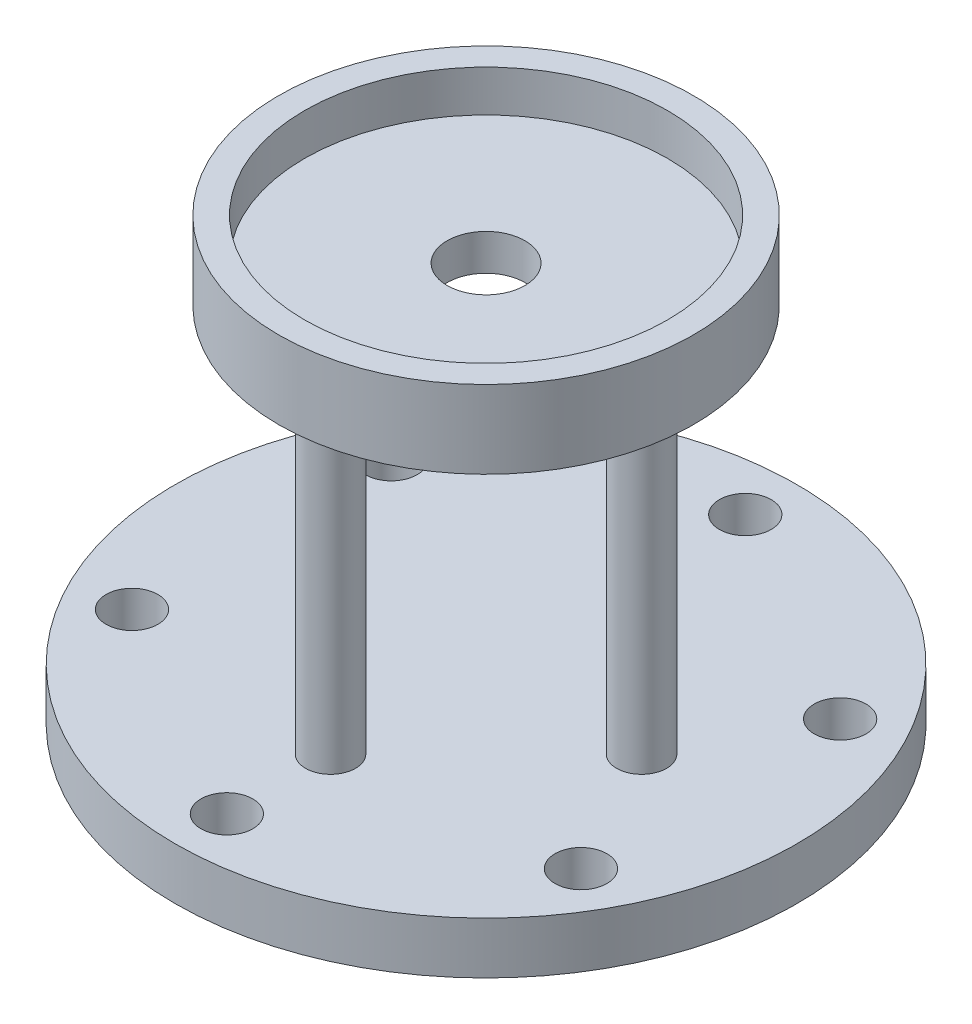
ISO-10303-21;
HEADER;
FILE_DESCRIPTION(('STEP AP214'),'2;1');
FILE_NAME('part.step','',(''),(''),'','','');
FILE_SCHEMA(('AUTOMOTIVE_DESIGN { 1 0 10303 214 1 1 1 1 }'));
ENDSEC;
DATA;
#1=APPLICATION_CONTEXT('core data for automotive mechanical design processes');
#2=APPLICATION_PROTOCOL_DEFINITION('international standard','automotive_design',2000,#1);
#3=PRODUCT_CONTEXT('',#1,'mechanical');
#4=PRODUCT('Part','Part','',(#3));
#5=PRODUCT_RELATED_PRODUCT_CATEGORY('part','',(#4));
#6=PRODUCT_DEFINITION_FORMATION('','',#4);
#7=PRODUCT_DEFINITION_CONTEXT('part definition',#1,'design');
#8=PRODUCT_DEFINITION('design','',#6,#7);
#9=PRODUCT_DEFINITION_SHAPE('','',#8);
#10=(LENGTH_UNIT() NAMED_UNIT(*) SI_UNIT(.MILLI.,.METRE.));
#11=(NAMED_UNIT(*) PLANE_ANGLE_UNIT() SI_UNIT($,.RADIAN.));
#12=(NAMED_UNIT(*) SI_UNIT($,.STERADIAN.) SOLID_ANGLE_UNIT());
#13=UNCERTAINTY_MEASURE_WITH_UNIT(LENGTH_MEASURE(1.E-05),#10,'distance_accuracy_value','');
#14=(GEOMETRIC_REPRESENTATION_CONTEXT(3) GLOBAL_UNCERTAINTY_ASSIGNED_CONTEXT((#13)) GLOBAL_UNIT_ASSIGNED_CONTEXT((#10,
#11,#12)) REPRESENTATION_CONTEXT('',''));
#15=CARTESIAN_POINT('',(0.,0.,0.));
#16=DIRECTION('',(0.,0.,1.));
#17=DIRECTION('',(1.,0.,0.));
#18=AXIS2_PLACEMENT_3D('',#15,#16,#17);
#19=CARTESIAN_POINT('',(0.,77.,0.));
#20=DIRECTION('',(0.,1.,0.));
#21=DIRECTION('',(0.,0.,1.));
#22=AXIS2_PLACEMENT_3D('',#19,#20,#21);
#23=PLANE('',#22);
#24=CARTESIAN_POINT('',(0.,77.,0.));
#25=DIRECTION('',(0.,1.,0.));
#26=DIRECTION('',(0.,0.,1.));
#27=AXIS2_PLACEMENT_3D('',#24,#25,#26);
#28=CIRCLE('',#27,7.5);
#29=CARTESIAN_POINT('',(0.,77.,7.5));
#30=VERTEX_POINT('',#29);
#31=EDGE_CURVE('E119',#30,#30,#28,.T.);
#32=ORIENTED_EDGE('',*,*,#31,.F.);
#33=EDGE_LOOP('',(#32));
#34=FACE_BOUND('',#33,.T.);
#35=CARTESIAN_POINT('',(0.,77.,0.));
#36=DIRECTION('',(0.,1.,0.));
#37=DIRECTION('',(0.,0.,1.));
#38=AXIS2_PLACEMENT_3D('',#35,#36,#37);
#39=CIRCLE('',#38,35.);
#40=CARTESIAN_POINT('',(0.,77.,35.));
#41=VERTEX_POINT('',#40);
#42=EDGE_CURVE('E10',#41,#41,#39,.F.);
#43=ORIENTED_EDGE('',*,*,#42,.F.);
#44=EDGE_LOOP('',(#43));
#45=FACE_BOUND('',#44,.T.);
#46=ADVANCED_FACE('F39',(#34,#45),#23,.T.);
#47=CARTESIAN_POINT('',(0.,10.,0.));
#48=DIRECTION('',(0.,1.,0.));
#49=DIRECTION('',(0.,0.,1.));
#50=AXIS2_PLACEMENT_3D('',#47,#48,#49);
#51=PLANE('',#50);
#52=CARTESIAN_POINT('',(0.,10.,30.));
#53=DIRECTION('',(0.,1.,0.));
#54=DIRECTION('',(0.,0.,1.));
#55=AXIS2_PLACEMENT_3D('',#52,#53,#54);
#56=CIRCLE('',#55,4.81807950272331);
#57=CARTESIAN_POINT('',(0.,10.,34.8180795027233));
#58=VERTEX_POINT('',#57);
#59=EDGE_CURVE('E112',#58,#58,#56,.T.);
#60=ORIENTED_EDGE('',*,*,#59,.F.);
#61=EDGE_LOOP('',(#60));
#62=FACE_BOUND('',#61,.T.);
#63=CARTESIAN_POINT('',(30.,10.,0.));
#64=DIRECTION('',(0.,1.,0.));
#65=DIRECTION('',(0.,0.,1.));
#66=AXIS2_PLACEMENT_3D('',#63,#64,#65);
#67=CIRCLE('',#66,4.81807950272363);
#68=CARTESIAN_POINT('',(30.,10.,4.81807950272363));
#69=VERTEX_POINT('',#68);
#70=EDGE_CURVE('E109',#69,#69,#67,.T.);
#71=ORIENTED_EDGE('',*,*,#70,.F.);
#72=EDGE_LOOP('',(#71));
#73=FACE_BOUND('',#72,.T.);
#74=CARTESIAN_POINT('',(0.,10.,-30.));
#75=DIRECTION('',(0.,1.,0.));
#76=DIRECTION('',(0.,0.,1.));
#77=AXIS2_PLACEMENT_3D('',#74,#75,#76);
#78=CIRCLE('',#77,4.81807950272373);
#79=CARTESIAN_POINT('',(0.,10.,-25.1819204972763));
#80=VERTEX_POINT('',#79);
#81=EDGE_CURVE('E103',#80,#80,#78,.T.);
#82=ORIENTED_EDGE('',*,*,#81,.F.);
#83=EDGE_LOOP('',(#82));
#84=FACE_BOUND('',#83,.T.);
#85=CARTESIAN_POINT('',(-30.,10.,0.));
#86=DIRECTION('',(0.,1.,0.));
#87=DIRECTION('',(0.,0.,1.));
#88=AXIS2_PLACEMENT_3D('',#85,#86,#87);
#89=CIRCLE('',#88,4.81807950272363);
#90=CARTESIAN_POINT('',(-30.,10.,4.81807950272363));
#91=VERTEX_POINT('',#90);
#92=EDGE_CURVE('E96',#91,#91,#89,.T.);
#93=ORIENTED_EDGE('',*,*,#92,.F.);
#94=EDGE_LOOP('',(#93));
#95=FACE_BOUND('',#94,.T.);
#96=CARTESIAN_POINT('',(-43.3012701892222,10.,25.0000000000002));
#97=DIRECTION('',(0.,1.,0.));
#98=DIRECTION('',(0.,0.,1.));
#99=AXIS2_PLACEMENT_3D('',#96,#97,#98);
#100=CIRCLE('',#99,4.99999999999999);
#101=CARTESIAN_POINT('',(-43.3012701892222,10.,30.0000000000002));
#102=VERTEX_POINT('',#101);
#103=EDGE_CURVE('E78',#102,#102,#100,.T.);
#104=ORIENTED_EDGE('',*,*,#103,.F.);
#105=EDGE_LOOP('',(#104));
#106=FACE_BOUND('',#105,.T.);
#107=CARTESIAN_POINT('',(43.301270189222,10.,25.0000000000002));
#108=DIRECTION('',(0.,1.,0.));
#109=DIRECTION('',(0.,0.,1.));
#110=AXIS2_PLACEMENT_3D('',#107,#108,#109);
#111=CIRCLE('',#110,4.99999999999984);
#112=CARTESIAN_POINT('',(43.301270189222,10.,30.));
#113=VERTEX_POINT('',#112);
#114=EDGE_CURVE('E66',#113,#113,#111,.T.);
#115=ORIENTED_EDGE('',*,*,#114,.F.);
#116=EDGE_LOOP('',(#115));
#117=FACE_BOUND('',#116,.T.);
#118=CARTESIAN_POINT('',(0.,10.,-50.));
#119=DIRECTION('',(0.,1.,0.));
#120=DIRECTION('',(0.,0.,1.));
#121=AXIS2_PLACEMENT_3D('',#118,#119,#120);
#122=CIRCLE('',#121,5.);
#123=CARTESIAN_POINT('',(0.,10.,-45.));
#124=VERTEX_POINT('',#123);
#125=EDGE_CURVE('E55',#124,#124,#122,.T.);
#126=ORIENTED_EDGE('',*,*,#125,.F.);
#127=EDGE_LOOP('',(#126));
#128=FACE_BOUND('',#127,.T.);
#129=CARTESIAN_POINT('',(0.,10.,0.));
#130=DIRECTION('',(0.,1.,0.));
#131=DIRECTION('',(0.,0.,1.));
#132=AXIS2_PLACEMENT_3D('',#129,#130,#131);
#133=CIRCLE('',#132,60.);
#134=CARTESIAN_POINT('',(0.,10.,60.));
#135=VERTEX_POINT('',#134);
#136=EDGE_CURVE('E46',#135,#135,#133,.T.);
#137=ORIENTED_EDGE('',*,*,#136,.T.);
#138=EDGE_LOOP('',(#137));
#139=FACE_BOUND('',#138,.T.);
#140=CARTESIAN_POINT('',(43.301270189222,10.,-24.9999999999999));
#141=DIRECTION('',(0.,1.,0.));
#142=DIRECTION('',(0.,0.,1.));
#143=AXIS2_PLACEMENT_3D('',#140,#141,#142);
#144=CIRCLE('',#143,5.);
#145=CARTESIAN_POINT('',(43.301270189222,10.,-19.9999999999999));
#146=VERTEX_POINT('',#145);
#147=EDGE_CURVE('E60',#146,#146,#144,.T.);
#148=ORIENTED_EDGE('',*,*,#147,.F.);
#149=EDGE_LOOP('',(#148));
#150=FACE_BOUND('',#149,.T.);
#151=CARTESIAN_POINT('',(0.,10.,50.));
#152=DIRECTION('',(0.,1.,0.));
#153=DIRECTION('',(0.,0.,1.));
#154=AXIS2_PLACEMENT_3D('',#151,#152,#153);
#155=CIRCLE('',#154,4.99999999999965);
#156=CARTESIAN_POINT('',(0.,10.,54.9999999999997));
#157=VERTEX_POINT('',#156);
#158=EDGE_CURVE('E72',#157,#157,#155,.T.);
#159=ORIENTED_EDGE('',*,*,#158,.F.);
#160=EDGE_LOOP('',(#159));
#161=FACE_BOUND('',#160,.T.);
#162=CARTESIAN_POINT('',(-43.3012701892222,10.,-24.9999999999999));
#163=DIRECTION('',(0.,1.,0.));
#164=DIRECTION('',(0.,0.,1.));
#165=AXIS2_PLACEMENT_3D('',#162,#163,#164);
#166=CIRCLE('',#165,5.00000000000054);
#167=CARTESIAN_POINT('',(-43.3012701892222,10.,-19.9999999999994));
#168=VERTEX_POINT('',#167);
#169=EDGE_CURVE('E84',#168,#168,#166,.T.);
#170=ORIENTED_EDGE('',*,*,#169,.F.);
#171=EDGE_LOOP('',(#170));
#172=FACE_BOUND('',#171,.T.);
#173=ADVANCED_FACE('F149',(#62,#73,#84,#95,#106,#117,#128,#139,#150,#161,#172),#51,.T.);
#174=CARTESIAN_POINT('',(0.,0.,0.));
#175=DIRECTION('',(0.,1.,0.));
#176=DIRECTION('',(0.,0.,1.));
#177=AXIS2_PLACEMENT_3D('',#174,#175,#176);
#178=PLANE('',#177);
#179=CARTESIAN_POINT('',(0.,0.,0.));
#180=DIRECTION('',(0.,1.,0.));
#181=DIRECTION('',(0.,0.,1.));
#182=AXIS2_PLACEMENT_3D('',#179,#180,#181);
#183=CIRCLE('',#182,60.);
#184=CARTESIAN_POINT('',(0.,0.,60.));
#185=VERTEX_POINT('',#184);
#186=EDGE_CURVE('E50',#185,#185,#183,.T.);
#187=ORIENTED_EDGE('',*,*,#186,.F.);
#188=EDGE_LOOP('',(#187));
#189=FACE_BOUND('',#188,.T.);
#190=CARTESIAN_POINT('',(0.,0.,-50.));
#191=DIRECTION('',(0.,1.,0.));
#192=DIRECTION('',(0.,0.,1.));
#193=AXIS2_PLACEMENT_3D('',#190,#191,#192);
#194=CIRCLE('',#193,5.);
#195=CARTESIAN_POINT('',(0.,0.,-45.));
#196=VERTEX_POINT('',#195);
#197=EDGE_CURVE('E57',#196,#196,#194,.T.);
#198=ORIENTED_EDGE('',*,*,#197,.T.);
#199=EDGE_LOOP('',(#198));
#200=FACE_BOUND('',#199,.T.);
#201=CARTESIAN_POINT('',(43.301270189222,0.,-24.9999999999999));
#202=DIRECTION('',(0.,1.,0.));
#203=DIRECTION('',(0.,0.,1.));
#204=AXIS2_PLACEMENT_3D('',#201,#202,#203);
#205=CIRCLE('',#204,5.);
#206=CARTESIAN_POINT('',(43.301270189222,0.,-19.9999999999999));
#207=VERTEX_POINT('',#206);
#208=EDGE_CURVE('E63',#207,#207,#205,.T.);
#209=ORIENTED_EDGE('',*,*,#208,.T.);
#210=EDGE_LOOP('',(#209));
#211=FACE_BOUND('',#210,.T.);
#212=CARTESIAN_POINT('',(43.301270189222,0.,25.0000000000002));
#213=DIRECTION('',(0.,1.,0.));
#214=DIRECTION('',(0.,0.,1.));
#215=AXIS2_PLACEMENT_3D('',#212,#213,#214);
#216=CIRCLE('',#215,4.99999999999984);
#217=CARTESIAN_POINT('',(43.301270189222,0.,30.));
#218=VERTEX_POINT('',#217);
#219=EDGE_CURVE('E69',#218,#218,#216,.T.);
#220=ORIENTED_EDGE('',*,*,#219,.T.);
#221=EDGE_LOOP('',(#220));
#222=FACE_BOUND('',#221,.T.);
#223=CARTESIAN_POINT('',(0.,0.,50.));
#224=DIRECTION('',(0.,1.,0.));
#225=DIRECTION('',(0.,0.,1.));
#226=AXIS2_PLACEMENT_3D('',#223,#224,#225);
#227=CIRCLE('',#226,4.99999999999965);
#228=CARTESIAN_POINT('',(0.,0.,54.9999999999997));
#229=VERTEX_POINT('',#228);
#230=EDGE_CURVE('E75',#229,#229,#227,.T.);
#231=ORIENTED_EDGE('',*,*,#230,.T.);
#232=EDGE_LOOP('',(#231));
#233=FACE_BOUND('',#232,.T.);
#234=CARTESIAN_POINT('',(-43.3012701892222,0.,25.0000000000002));
#235=DIRECTION('',(0.,1.,0.));
#236=DIRECTION('',(0.,0.,1.));
#237=AXIS2_PLACEMENT_3D('',#234,#235,#236);
#238=CIRCLE('',#237,4.99999999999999);
#239=CARTESIAN_POINT('',(-43.3012701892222,0.,30.0000000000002));
#240=VERTEX_POINT('',#239);
#241=EDGE_CURVE('E81',#240,#240,#238,.T.);
#242=ORIENTED_EDGE('',*,*,#241,.T.);
#243=EDGE_LOOP('',(#242));
#244=FACE_BOUND('',#243,.T.);
#245=CARTESIAN_POINT('',(-43.3012701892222,0.,-24.9999999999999));
#246=DIRECTION('',(0.,1.,0.));
#247=DIRECTION('',(0.,0.,1.));
#248=AXIS2_PLACEMENT_3D('',#245,#246,#247);
#249=CIRCLE('',#248,5.00000000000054);
#250=CARTESIAN_POINT('',(-43.3012701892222,0.,-19.9999999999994));
#251=VERTEX_POINT('',#250);
#252=EDGE_CURVE('E87',#251,#251,#249,.T.);
#253=ORIENTED_EDGE('',*,*,#252,.T.);
#254=EDGE_LOOP('',(#253));
#255=FACE_BOUND('',#254,.T.);
#256=ADVANCED_FACE('F155',(#189,#200,#211,#222,#233,#244,#255),#178,.F.);
#257=CARTESIAN_POINT('',(0.,10.,0.));
#258=DIRECTION('',(0.,-1.,0.));
#259=DIRECTION('',(0.,0.,-1.));
#260=AXIS2_PLACEMENT_3D('',#257,#258,#259);
#261=CYLINDRICAL_SURFACE('',#260,60.);
#262=ORIENTED_EDGE('',*,*,#136,.F.);
#263=EDGE_LOOP('',(#262));
#264=FACE_BOUND('',#263,.T.);
#265=ORIENTED_EDGE('',*,*,#186,.T.);
#266=EDGE_LOOP('',(#265));
#267=FACE_BOUND('',#266,.T.);
#268=ADVANCED_FACE('F41',(#264,#267),#261,.T.);
#269=CARTESIAN_POINT('',(0.,10.,-50.));
#270=DIRECTION('',(0.,-1.,0.));
#271=DIRECTION('',(0.,0.,-1.));
#272=AXIS2_PLACEMENT_3D('',#269,#270,#271);
#273=CYLINDRICAL_SURFACE('',#272,5.);
#274=ORIENTED_EDGE('',*,*,#125,.T.);
#275=EDGE_LOOP('',(#274));
#276=FACE_BOUND('',#275,.T.);
#277=ORIENTED_EDGE('',*,*,#197,.F.);
#278=EDGE_LOOP('',(#277));
#279=FACE_BOUND('',#278,.T.);
#280=ADVANCED_FACE('F202',(#276,#279),#273,.F.);
#281=CARTESIAN_POINT('',(43.301270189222,10.,-24.9999999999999));
#282=DIRECTION('',(0.,-1.,0.));
#283=DIRECTION('',(0.,0.,-1.));
#284=AXIS2_PLACEMENT_3D('',#281,#282,#283);
#285=CYLINDRICAL_SURFACE('',#284,5.);
#286=ORIENTED_EDGE('',*,*,#147,.T.);
#287=EDGE_LOOP('',(#286));
#288=FACE_BOUND('',#287,.T.);
#289=ORIENTED_EDGE('',*,*,#208,.F.);
#290=EDGE_LOOP('',(#289));
#291=FACE_BOUND('',#290,.T.);
#292=ADVANCED_FACE('F198',(#288,#291),#285,.F.);
#293=CARTESIAN_POINT('',(43.301270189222,10.,25.0000000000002));
#294=DIRECTION('',(0.,-1.,0.));
#295=DIRECTION('',(0.,0.,-1.));
#296=AXIS2_PLACEMENT_3D('',#293,#294,#295);
#297=CYLINDRICAL_SURFACE('',#296,4.99999999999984);
#298=ORIENTED_EDGE('',*,*,#114,.T.);
#299=EDGE_LOOP('',(#298));
#300=FACE_BOUND('',#299,.T.);
#301=ORIENTED_EDGE('',*,*,#219,.F.);
#302=EDGE_LOOP('',(#301));
#303=FACE_BOUND('',#302,.T.);
#304=ADVANCED_FACE('F194',(#300,#303),#297,.F.);
#305=CARTESIAN_POINT('',(0.,10.,50.));
#306=DIRECTION('',(0.,-1.,0.));
#307=DIRECTION('',(0.,0.,-1.));
#308=AXIS2_PLACEMENT_3D('',#305,#306,#307);
#309=CYLINDRICAL_SURFACE('',#308,4.99999999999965);
#310=ORIENTED_EDGE('',*,*,#158,.T.);
#311=EDGE_LOOP('',(#310));
#312=FACE_BOUND('',#311,.T.);
#313=ORIENTED_EDGE('',*,*,#230,.F.);
#314=EDGE_LOOP('',(#313));
#315=FACE_BOUND('',#314,.T.);
#316=ADVANCED_FACE('F190',(#312,#315),#309,.F.);
#317=CARTESIAN_POINT('',(-43.3012701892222,10.,25.0000000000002));
#318=DIRECTION('',(0.,-1.,0.));
#319=DIRECTION('',(0.,0.,-1.));
#320=AXIS2_PLACEMENT_3D('',#317,#318,#319);
#321=CYLINDRICAL_SURFACE('',#320,4.99999999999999);
#322=ORIENTED_EDGE('',*,*,#103,.T.);
#323=EDGE_LOOP('',(#322));
#324=FACE_BOUND('',#323,.T.);
#325=ORIENTED_EDGE('',*,*,#241,.F.);
#326=EDGE_LOOP('',(#325));
#327=FACE_BOUND('',#326,.T.);
#328=ADVANCED_FACE('F186',(#324,#327),#321,.F.);
#329=CARTESIAN_POINT('',(-43.3012701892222,10.,-24.9999999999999));
#330=DIRECTION('',(0.,-1.,0.));
#331=DIRECTION('',(0.,0.,-1.));
#332=AXIS2_PLACEMENT_3D('',#329,#330,#331);
#333=CYLINDRICAL_SURFACE('',#332,5.00000000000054);
#334=ORIENTED_EDGE('',*,*,#169,.T.);
#335=EDGE_LOOP('',(#334));
#336=FACE_BOUND('',#335,.T.);
#337=ORIENTED_EDGE('',*,*,#252,.F.);
#338=EDGE_LOOP('',(#337));
#339=FACE_BOUND('',#338,.T.);
#340=ADVANCED_FACE('F182',(#336,#339),#333,.F.);
#341=CARTESIAN_POINT('',(-30.,70.,0.));
#342=DIRECTION('',(0.,-1.,0.));
#343=DIRECTION('',(0.,0.,-1.));
#344=AXIS2_PLACEMENT_3D('',#341,#342,#343);
#345=CYLINDRICAL_SURFACE('',#344,4.81807950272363);
#346=CARTESIAN_POINT('',(-30.,70.,0.));
#347=DIRECTION('',(0.,1.,0.));
#348=DIRECTION('',(0.,0.,1.));
#349=AXIS2_PLACEMENT_3D('',#346,#347,#348);
#350=CIRCLE('',#349,4.81807950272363);
#351=CARTESIAN_POINT('',(-30.,70.,4.81807950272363));
#352=VERTEX_POINT('',#351);
#353=EDGE_CURVE('E93',#352,#352,#350,.T.);
#354=ORIENTED_EDGE('',*,*,#353,.F.);
#355=EDGE_LOOP('',(#354));
#356=FACE_BOUND('',#355,.T.);
#357=ORIENTED_EDGE('',*,*,#92,.T.);
#358=EDGE_LOOP('',(#357));
#359=FACE_BOUND('',#358,.T.);
#360=ADVANCED_FACE('F178',(#356,#359),#345,.T.);
#361=CARTESIAN_POINT('',(0.,70.,-30.));
#362=DIRECTION('',(0.,-1.,0.));
#363=DIRECTION('',(0.,0.,-1.));
#364=AXIS2_PLACEMENT_3D('',#361,#362,#363);
#365=CYLINDRICAL_SURFACE('',#364,4.81807950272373);
#366=CARTESIAN_POINT('',(0.,70.,-30.));
#367=DIRECTION('',(0.,1.,0.));
#368=DIRECTION('',(0.,0.,1.));
#369=AXIS2_PLACEMENT_3D('',#366,#367,#368);
#370=CIRCLE('',#369,4.81807950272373);
#371=CARTESIAN_POINT('',(0.,70.,-25.1819204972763));
#372=VERTEX_POINT('',#371);
#373=EDGE_CURVE('E100',#372,#372,#370,.T.);
#374=ORIENTED_EDGE('',*,*,#373,.F.);
#375=EDGE_LOOP('',(#374));
#376=FACE_BOUND('',#375,.T.);
#377=ORIENTED_EDGE('',*,*,#81,.T.);
#378=EDGE_LOOP('',(#377));
#379=FACE_BOUND('',#378,.T.);
#380=ADVANCED_FACE('F174',(#376,#379),#365,.T.);
#381=CARTESIAN_POINT('',(30.,70.,0.));
#382=DIRECTION('',(0.,-1.,0.));
#383=DIRECTION('',(0.,0.,-1.));
#384=AXIS2_PLACEMENT_3D('',#381,#382,#383);
#385=CYLINDRICAL_SURFACE('',#384,4.81807950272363);
#386=CARTESIAN_POINT('',(30.,70.,0.));
#387=DIRECTION('',(0.,1.,0.));
#388=DIRECTION('',(0.,0.,1.));
#389=AXIS2_PLACEMENT_3D('',#386,#387,#388);
#390=CIRCLE('',#389,4.81807950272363);
#391=CARTESIAN_POINT('',(30.,70.,4.81807950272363));
#392=VERTEX_POINT('',#391);
#393=EDGE_CURVE('E106',#392,#392,#390,.T.);
#394=ORIENTED_EDGE('',*,*,#393,.F.);
#395=EDGE_LOOP('',(#394));
#396=FACE_BOUND('',#395,.T.);
#397=ORIENTED_EDGE('',*,*,#70,.T.);
#398=EDGE_LOOP('',(#397));
#399=FACE_BOUND('',#398,.T.);
#400=ADVANCED_FACE('F170',(#396,#399),#385,.T.);
#401=CARTESIAN_POINT('',(0.,70.,30.));
#402=DIRECTION('',(0.,-1.,0.));
#403=DIRECTION('',(0.,0.,-1.));
#404=AXIS2_PLACEMENT_3D('',#401,#402,#403);
#405=CYLINDRICAL_SURFACE('',#404,4.81807950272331);
#406=CARTESIAN_POINT('',(0.,70.,30.));
#407=DIRECTION('',(0.,1.,0.));
#408=DIRECTION('',(0.,0.,1.));
#409=AXIS2_PLACEMENT_3D('',#406,#407,#408);
#410=CIRCLE('',#409,4.81807950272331);
#411=CARTESIAN_POINT('',(0.,70.,34.8180795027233));
#412=VERTEX_POINT('',#411);
#413=EDGE_CURVE('E90',#412,#412,#410,.T.);
#414=ORIENTED_EDGE('',*,*,#413,.F.);
#415=EDGE_LOOP('',(#414));
#416=FACE_BOUND('',#415,.T.);
#417=ORIENTED_EDGE('',*,*,#59,.T.);
#418=EDGE_LOOP('',(#417));
#419=FACE_BOUND('',#418,.T.);
#420=ADVANCED_FACE('F164',(#416,#419),#405,.T.);
#421=CARTESIAN_POINT('',(0.,70.,0.));
#422=DIRECTION('',(0.,1.,0.));
#423=DIRECTION('',(0.,0.,1.));
#424=AXIS2_PLACEMENT_3D('',#421,#422,#423);
#425=PLANE('',#424);
#426=ORIENTED_EDGE('',*,*,#353,.T.);
#427=EDGE_LOOP('',(#426));
#428=FACE_BOUND('',#427,.T.);
#429=ORIENTED_EDGE('',*,*,#373,.T.);
#430=EDGE_LOOP('',(#429));
#431=FACE_BOUND('',#430,.T.);
#432=ORIENTED_EDGE('',*,*,#393,.T.);
#433=EDGE_LOOP('',(#432));
#434=FACE_BOUND('',#433,.T.);
#435=ORIENTED_EDGE('',*,*,#413,.T.);
#436=EDGE_LOOP('',(#435));
#437=FACE_BOUND('',#436,.T.);
#438=CARTESIAN_POINT('',(0.,70.,0.));
#439=DIRECTION('',(0.,1.,0.));
#440=DIRECTION('',(0.,0.,1.));
#441=AXIS2_PLACEMENT_3D('',#438,#439,#440);
#442=CIRCLE('',#441,40.);
#443=CARTESIAN_POINT('',(0.,70.,40.));
#444=VERTEX_POINT('',#443);
#445=EDGE_CURVE('E97',#444,#444,#442,.T.);
#446=ORIENTED_EDGE('',*,*,#445,.F.);
#447=EDGE_LOOP('',(#446));
#448=FACE_BOUND('',#447,.T.);
#449=CARTESIAN_POINT('',(0.,70.,0.));
#450=DIRECTION('',(0.,1.,0.));
#451=DIRECTION('',(0.,0.,1.));
#452=AXIS2_PLACEMENT_3D('',#449,#450,#451);
#453=CIRCLE('',#452,7.5);
#454=CARTESIAN_POINT('',(0.,70.,7.5));
#455=VERTEX_POINT('',#454);
#456=EDGE_CURVE('E120',#455,#455,#453,.T.);
#457=ORIENTED_EDGE('',*,*,#456,.T.);
#458=EDGE_LOOP('',(#457));
#459=FACE_BOUND('',#458,.T.);
#460=ADVANCED_FACE('F161',(#428,#431,#434,#437,#448,#459),#425,.F.);
#461=CARTESIAN_POINT('',(0.,77.,0.));
#462=DIRECTION('',(0.,-1.,0.));
#463=DIRECTION('',(0.,0.,-1.));
#464=AXIS2_PLACEMENT_3D('',#461,#462,#463);
#465=CYLINDRICAL_SURFACE('',#464,40.);
#466=ORIENTED_EDGE('',*,*,#445,.T.);
#467=EDGE_LOOP('',(#466));
#468=FACE_BOUND('',#467,.T.);
#469=CARTESIAN_POINT('',(0.,85.,0.));
#470=DIRECTION('',(0.,1.,0.));
#471=DIRECTION('',(0.,0.,1.));
#472=AXIS2_PLACEMENT_3D('',#469,#470,#471);
#473=CIRCLE('',#472,40.);
#474=CARTESIAN_POINT('',(0.,85.,40.));
#475=VERTEX_POINT('',#474);
#476=EDGE_CURVE('E123',#475,#475,#473,.T.);
#477=ORIENTED_EDGE('',*,*,#476,.F.);
#478=EDGE_LOOP('',(#477));
#479=FACE_BOUND('',#478,.T.);
#480=ADVANCED_FACE('F145',(#468,#479),#465,.T.);
#481=CARTESIAN_POINT('',(0.,77.,0.));
#482=DIRECTION('',(0.,-1.,0.));
#483=DIRECTION('',(0.,0.,-1.));
#484=AXIS2_PLACEMENT_3D('',#481,#482,#483);
#485=CYLINDRICAL_SURFACE('',#484,7.5);
#486=ORIENTED_EDGE('',*,*,#31,.T.);
#487=EDGE_LOOP('',(#486));
#488=FACE_BOUND('',#487,.T.);
#489=ORIENTED_EDGE('',*,*,#456,.F.);
#490=EDGE_LOOP('',(#489));
#491=FACE_BOUND('',#490,.T.);
#492=ADVANCED_FACE('F136',(#488,#491),#485,.F.);
#493=CARTESIAN_POINT('',(0.,85.,0.));
#494=DIRECTION('',(0.,1.,0.));
#495=DIRECTION('',(0.,0.,1.));
#496=AXIS2_PLACEMENT_3D('',#493,#494,#495);
#497=PLANE('',#496);
#498=ORIENTED_EDGE('',*,*,#476,.T.);
#499=EDGE_LOOP('',(#498));
#500=FACE_BOUND('',#499,.T.);
#501=CARTESIAN_POINT('',(0.,85.,0.));
#502=DIRECTION('',(0.,1.,0.));
#503=DIRECTION('',(0.,0.,1.));
#504=AXIS2_PLACEMENT_3D('',#501,#502,#503);
#505=CIRCLE('',#504,35.);
#506=CARTESIAN_POINT('',(0.,85.,35.));
#507=VERTEX_POINT('',#506);
#508=EDGE_CURVE('E128',#507,#507,#505,.T.);
#509=ORIENTED_EDGE('',*,*,#508,.F.);
#510=EDGE_LOOP('',(#509));
#511=FACE_BOUND('',#510,.T.);
#512=ADVANCED_FACE('F134',(#500,#511),#497,.T.);
#513=CARTESIAN_POINT('',(0.,85.,0.));
#514=DIRECTION('',(0.,-1.,0.));
#515=DIRECTION('',(0.,0.,-1.));
#516=AXIS2_PLACEMENT_3D('',#513,#514,#515);
#517=CYLINDRICAL_SURFACE('',#516,35.);
#518=ORIENTED_EDGE('',*,*,#508,.T.);
#519=EDGE_LOOP('',(#518));
#520=FACE_BOUND('',#519,.T.);
#521=ORIENTED_EDGE('',*,*,#42,.T.);
#522=EDGE_LOOP('',(#521));
#523=FACE_BOUND('',#522,.T.);
#524=ADVANCED_FACE('F132',(#520,#523),#517,.F.);
#525=CLOSED_SHELL('',(#46,#173,#256,#268,#280,#292,#304,#316,#328,#340,#360,#380,#400,#420,#460,
#480,#492,#512,#524));
#526=MANIFOLD_SOLID_BREP('B2',#525);
#527=ADVANCED_BREP_SHAPE_REPRESENTATION('',(#18,#526),#14);
#528=SHAPE_DEFINITION_REPRESENTATION(#9,#527);
ENDSEC;
END-ISO-10303-21;
